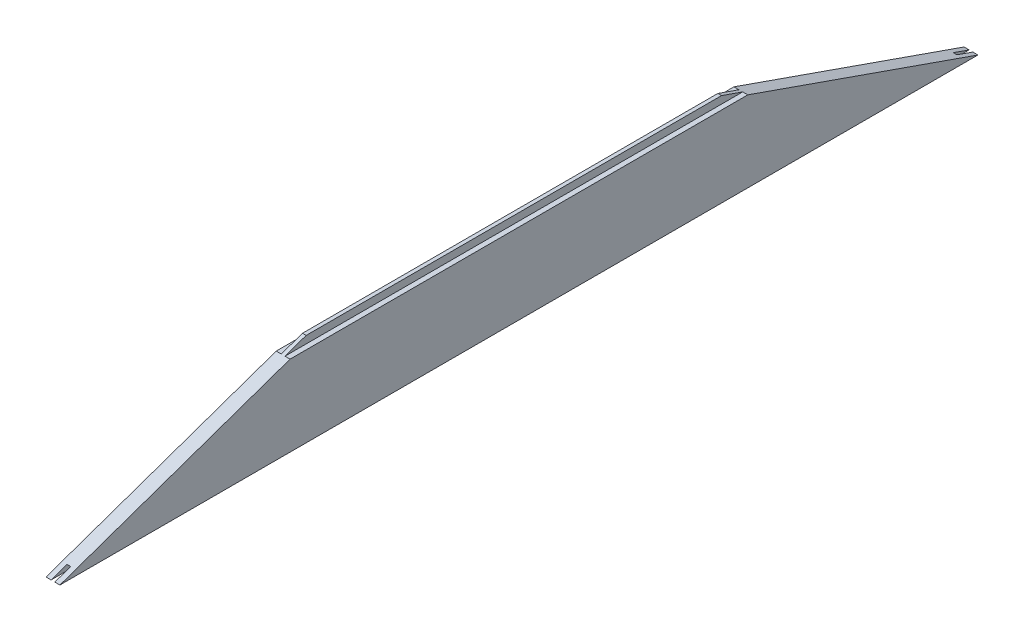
ISO-10303-21;
HEADER;
FILE_DESCRIPTION(('STEP AP214'),'2;1');
FILE_NAME('part.step','',(''),(''),'','','');
FILE_SCHEMA(('AUTOMOTIVE_DESIGN { 1 0 10303 214 1 1 1 1 }'));
ENDSEC;
DATA;
#1=APPLICATION_CONTEXT('core data for automotive mechanical design processes');
#2=APPLICATION_PROTOCOL_DEFINITION('international standard','automotive_design',2000,#1);
#3=PRODUCT_CONTEXT('',#1,'mechanical');
#4=PRODUCT('Part','Part','',(#3));
#5=PRODUCT_RELATED_PRODUCT_CATEGORY('part','',(#4));
#6=PRODUCT_DEFINITION_FORMATION('','',#4);
#7=PRODUCT_DEFINITION_CONTEXT('part definition',#1,'design');
#8=PRODUCT_DEFINITION('design','',#6,#7);
#9=PRODUCT_DEFINITION_SHAPE('','',#8);
#10=(LENGTH_UNIT() NAMED_UNIT(*) SI_UNIT(.MILLI.,.METRE.));
#11=(NAMED_UNIT(*) PLANE_ANGLE_UNIT() SI_UNIT($,.RADIAN.));
#12=(NAMED_UNIT(*) SI_UNIT($,.STERADIAN.) SOLID_ANGLE_UNIT());
#13=UNCERTAINTY_MEASURE_WITH_UNIT(LENGTH_MEASURE(1.E-05),#10,'distance_accuracy_value','');
#14=(GEOMETRIC_REPRESENTATION_CONTEXT(3) GLOBAL_UNCERTAINTY_ASSIGNED_CONTEXT((#13)) GLOBAL_UNIT_ASSIGNED_CONTEXT((#10,
#11,#12)) REPRESENTATION_CONTEXT('',''));
#15=CARTESIAN_POINT('',(0.,0.,0.));
#16=DIRECTION('',(0.,0.,1.));
#17=DIRECTION('',(1.,0.,0.));
#18=AXIS2_PLACEMENT_3D('',#15,#16,#17);
#19=CARTESIAN_POINT('',(2.00000000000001,0.,991.4));
#20=DIRECTION('',(1.,0.,0.));
#21=DIRECTION('',(0.,1.,0.));
#22=AXIS2_PLACEMENT_3D('',#19,#20,#21);
#23=PLANE('',#22);
#24=DIRECTION('',(0.,0.330349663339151,-0.943858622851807));
#25=VECTOR('',#24,1.);
#26=CARTESIAN_POINT('',(2.00000000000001,-38.7528058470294,977.836553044));
#27=LINE('',#26,#25);
#28=CARTESIAN_POINT('',(2.,43.5,742.827928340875));
#29=VERTEX_POINT('',#28);
#30=CARTESIAN_POINT('',(2.,51.5,719.970726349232));
#31=VERTEX_POINT('',#30);
#32=EDGE_CURVE('E229',#29,#31,#27,.T.);
#33=ORIENTED_EDGE('',*,*,#32,.F.);
#34=DIRECTION('',(0.,0.,-1.));
#35=VECTOR('',#34,1.);
#36=CARTESIAN_POINT('',(2.,43.5,991.4));
#37=LINE('',#36,#35);
#38=CARTESIAN_POINT('',(2.,43.5,248.572071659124));
#39=VERTEX_POINT('',#38);
#40=EDGE_CURVE('E143',#29,#39,#37,.T.);
#41=ORIENTED_EDGE('',*,*,#40,.T.);
#42=DIRECTION('',(0.,0.330349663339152,0.943858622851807));
#43=VECTOR('',#42,1.);
#44=CARTESIAN_POINT('',(1.99999999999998,270.369063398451,896.771072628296));
#45=LINE('',#44,#43);
#46=CARTESIAN_POINT('',(2.,51.5,271.429273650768));
#47=VERTEX_POINT('',#46);
#48=EDGE_CURVE('E192',#39,#47,#45,.T.);
#49=ORIENTED_EDGE('',*,*,#48,.T.);
#50=DIRECTION('',(0.,0.,-1.));
#51=VECTOR('',#50,1.);
#52=CARTESIAN_POINT('',(2.,51.5,991.4));
#53=LINE('',#52,#51);
#54=EDGE_CURVE('E11',#31,#47,#53,.T.);
#55=ORIENTED_EDGE('',*,*,#54,.F.);
#56=EDGE_LOOP('',(#33,#41,#49,#55));
#57=FACE_BOUND('',#56,.T.);
#58=ADVANCED_FACE('F32',(#57),#23,.T.);
#59=CARTESIAN_POINT('',(0.,51.5,991.4));
#60=DIRECTION('',(0.,1.,0.));
#61=DIRECTION('',(0.,0.,1.));
#62=AXIS2_PLACEMENT_3D('',#59,#60,#61);
#63=PLANE('',#62);
#64=DIRECTION('',(1.,0.,0.));
#65=VECTOR('',#64,1.);
#66=CARTESIAN_POINT('',(-7.50000000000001,51.5,719.970726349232));
#67=LINE('',#66,#65);
#68=CARTESIAN_POINT('',(-2.,51.5,719.970726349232));
#69=VERTEX_POINT('',#68);
#70=EDGE_CURVE('E124',#69,#31,#67,.T.);
#71=ORIENTED_EDGE('',*,*,#70,.T.);
#72=ORIENTED_EDGE('',*,*,#54,.T.);
#73=DIRECTION('',(1.,0.,0.));
#74=VECTOR('',#73,1.);
#75=CARTESIAN_POINT('',(-7.50000000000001,51.5,271.429273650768));
#76=LINE('',#75,#74);
#77=CARTESIAN_POINT('',(-2.,51.5,271.429273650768));
#78=VERTEX_POINT('',#77);
#79=EDGE_CURVE('E183',#78,#47,#76,.T.);
#80=ORIENTED_EDGE('',*,*,#79,.F.);
#81=DIRECTION('',(0.,0.,-1.));
#82=VECTOR('',#81,1.);
#83=CARTESIAN_POINT('',(-2.,51.5,991.4));
#84=LINE('',#83,#82);
#85=EDGE_CURVE('E40',#69,#78,#84,.T.);
#86=ORIENTED_EDGE('',*,*,#85,.F.);
#87=EDGE_LOOP('',(#71,#72,#80,#86));
#88=FACE_BOUND('',#87,.T.);
#89=ADVANCED_FACE('F187',(#88),#63,.T.);
#90=CARTESIAN_POINT('',(-1.99999999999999,0.,991.4));
#91=DIRECTION('',(1.,0.,0.));
#92=DIRECTION('',(0.,1.,0.));
#93=AXIS2_PLACEMENT_3D('',#90,#91,#92);
#94=PLANE('',#93);
#95=DIRECTION('',(0.,0.,-1.));
#96=VECTOR('',#95,1.);
#97=CARTESIAN_POINT('',(-2.,43.5,991.4));
#98=LINE('',#97,#96);
#99=CARTESIAN_POINT('',(-2.,43.5,742.827928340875));
#100=VERTEX_POINT('',#99);
#101=CARTESIAN_POINT('',(-2.,43.5,248.572071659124));
#102=VERTEX_POINT('',#101);
#103=EDGE_CURVE('E166',#100,#102,#98,.T.);
#104=ORIENTED_EDGE('',*,*,#103,.F.);
#105=DIRECTION('',(0.,0.330349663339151,-0.943858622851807));
#106=VECTOR('',#105,1.);
#107=CARTESIAN_POINT('',(-1.99999999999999,-38.7528058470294,977.836553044));
#108=LINE('',#107,#106);
#109=EDGE_CURVE('E174',#100,#69,#108,.T.);
#110=ORIENTED_EDGE('',*,*,#109,.T.);
#111=ORIENTED_EDGE('',*,*,#85,.T.);
#112=DIRECTION('',(0.,0.330349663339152,0.943858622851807));
#113=VECTOR('',#112,1.);
#114=CARTESIAN_POINT('',(-2.00000000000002,270.369063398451,896.771072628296));
#115=LINE('',#114,#113);
#116=EDGE_CURVE('E148',#102,#78,#115,.T.);
#117=ORIENTED_EDGE('',*,*,#116,.F.);
#118=EDGE_LOOP('',(#104,#110,#111,#117));
#119=FACE_BOUND('',#118,.T.);
#120=ADVANCED_FACE('F173',(#119),#94,.F.);
#121=CARTESIAN_POINT('',(0.,43.5,991.4));
#122=DIRECTION('',(0.,1.,0.));
#123=DIRECTION('',(0.,0.,1.));
#124=AXIS2_PLACEMENT_3D('',#121,#122,#123);
#125=PLANE('',#124);
#126=DIRECTION('',(-1.,0.,0.));
#127=VECTOR('',#126,1.);
#128=CARTESIAN_POINT('',(0.,43.5,742.827928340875));
#129=LINE('',#128,#127);
#130=CARTESIAN_POINT('',(-7.50000000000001,43.5000000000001,742.827928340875));
#131=VERTEX_POINT('',#130);
#132=EDGE_CURVE('E120',#100,#131,#129,.T.);
#133=ORIENTED_EDGE('',*,*,#132,.F.);
#134=ORIENTED_EDGE('',*,*,#103,.T.);
#135=DIRECTION('',(-1.,0.,0.));
#136=VECTOR('',#135,1.);
#137=CARTESIAN_POINT('',(0.,43.5,248.572071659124));
#138=LINE('',#137,#136);
#139=CARTESIAN_POINT('',(-7.50000000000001,43.5,248.572071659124));
#140=VERTEX_POINT('',#139);
#141=EDGE_CURVE('E186',#102,#140,#138,.T.);
#142=ORIENTED_EDGE('',*,*,#141,.T.);
#143=DIRECTION('',(0.,0.,-1.));
#144=VECTOR('',#143,1.);
#145=CARTESIAN_POINT('',(-7.50000000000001,43.5,991.4));
#146=LINE('',#145,#144);
#147=EDGE_CURVE('E134',#131,#140,#146,.T.);
#148=ORIENTED_EDGE('',*,*,#147,.F.);
#149=EDGE_LOOP('',(#133,#134,#142,#148));
#150=FACE_BOUND('',#149,.T.);
#151=ADVANCED_FACE('F208',(#150),#125,.T.);
#152=CARTESIAN_POINT('',(-7.5,0.,991.4));
#153=DIRECTION('',(1.,0.,0.));
#154=DIRECTION('',(0.,1.,0.));
#155=AXIS2_PLACEMENT_3D('',#152,#153,#154);
#156=PLANE('',#155);
#157=DIRECTION('',(0.,0.,-1.));
#158=VECTOR('',#157,1.);
#159=CARTESIAN_POINT('',(-7.5,-43.5,991.4));
#160=LINE('',#159,#158);
#161=CARTESIAN_POINT('',(-7.50000000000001,-43.5,991.4));
#162=VERTEX_POINT('',#161);
#163=CARTESIAN_POINT('',(-7.50000000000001,-43.5,0.));
#164=VERTEX_POINT('',#163);
#165=EDGE_CURVE('E128',#162,#164,#160,.T.);
#166=ORIENTED_EDGE('',*,*,#165,.F.);
#167=DIRECTION('',(0.,0.330349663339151,-0.943858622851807));
#168=VECTOR('',#167,1.);
#169=CARTESIAN_POINT('',(-7.50000000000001,-43.5,991.4));
#170=LINE('',#169,#168);
#171=EDGE_CURVE('E113',#162,#131,#170,.T.);
#172=ORIENTED_EDGE('',*,*,#171,.T.);
#173=ORIENTED_EDGE('',*,*,#147,.T.);
#174=DIRECTION('',(0.,0.330349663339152,0.943858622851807));
#175=VECTOR('',#174,1.);
#176=CARTESIAN_POINT('',(-7.50000000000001,-43.5,0.));
#177=LINE('',#176,#175);
#178=EDGE_CURVE('E131',#164,#140,#177,.T.);
#179=ORIENTED_EDGE('',*,*,#178,.F.);
#180=EDGE_LOOP('',(#166,#172,#173,#179));
#181=FACE_BOUND('',#180,.T.);
#182=ADVANCED_FACE('F129',(#181),#156,.F.);
#183=CARTESIAN_POINT('',(-2.00000000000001,0.,991.4));
#184=DIRECTION('',(1.,0.,0.));
#185=DIRECTION('',(0.,1.,0.));
#186=AXIS2_PLACEMENT_3D('',#183,#184,#185);
#187=PLANE('',#186);
#188=DIRECTION('',(0.,0.330349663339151,-0.943858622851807));
#189=VECTOR('',#188,1.);
#190=CARTESIAN_POINT('',(-2.,-38.7528058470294,977.836553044));
#191=LINE('',#190,#189);
#192=CARTESIAN_POINT('',(-2.,-43.5,991.4));
#193=VERTEX_POINT('',#192);
#194=CARTESIAN_POINT('',(-2.,-37.5,974.257098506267));
#195=VERTEX_POINT('',#194);
#196=EDGE_CURVE('E209',#193,#195,#191,.T.);
#197=ORIENTED_EDGE('',*,*,#196,.F.);
#198=DIRECTION('',(0.,0.,-1.));
#199=VECTOR('',#198,1.);
#200=CARTESIAN_POINT('',(-2.,-43.5,991.4));
#201=LINE('',#200,#199);
#202=CARTESIAN_POINT('',(-2.,-43.5,0.));
#203=VERTEX_POINT('',#202);
#204=EDGE_CURVE('E135',#193,#203,#201,.T.);
#205=ORIENTED_EDGE('',*,*,#204,.T.);
#206=DIRECTION('',(0.,0.330349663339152,0.943858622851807));
#207=VECTOR('',#206,1.);
#208=CARTESIAN_POINT('',(-2.00000000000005,270.369063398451,896.771072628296));
#209=LINE('',#208,#207);
#210=CARTESIAN_POINT('',(-2.,-37.5,17.1429014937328));
#211=VERTEX_POINT('',#210);
#212=EDGE_CURVE('E205',#203,#211,#209,.T.);
#213=ORIENTED_EDGE('',*,*,#212,.T.);
#214=DIRECTION('',(0.,0.,-1.));
#215=VECTOR('',#214,1.);
#216=CARTESIAN_POINT('',(-2.,-37.5,991.4));
#217=LINE('',#216,#215);
#218=EDGE_CURVE('E162',#195,#211,#217,.T.);
#219=ORIENTED_EDGE('',*,*,#218,.F.);
#220=EDGE_LOOP('',(#197,#205,#213,#219));
#221=FACE_BOUND('',#220,.T.);
#222=ADVANCED_FACE('F241',(#221),#187,.T.);
#223=CARTESIAN_POINT('',(0.,-37.5,991.4));
#224=DIRECTION('',(0.,1.,0.));
#225=DIRECTION('',(0.,0.,1.));
#226=AXIS2_PLACEMENT_3D('',#223,#224,#225);
#227=PLANE('',#226);
#228=DIRECTION('',(0.,0.,-1.));
#229=VECTOR('',#228,1.);
#230=CARTESIAN_POINT('',(2.,-37.5,991.4));
#231=LINE('',#230,#229);
#232=CARTESIAN_POINT('',(2.,-37.5,974.257098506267));
#233=VERTEX_POINT('',#232);
#234=CARTESIAN_POINT('',(2.,-37.5,17.1429014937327));
#235=VERTEX_POINT('',#234);
#236=EDGE_CURVE('E160',#233,#235,#231,.T.);
#237=ORIENTED_EDGE('',*,*,#236,.F.);
#238=DIRECTION('',(-1.,0.,0.));
#239=VECTOR('',#238,1.);
#240=CARTESIAN_POINT('',(0.,-37.5,974.257098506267));
#241=LINE('',#240,#239);
#242=EDGE_CURVE('E212',#233,#195,#241,.T.);
#243=ORIENTED_EDGE('',*,*,#242,.T.);
#244=ORIENTED_EDGE('',*,*,#218,.T.);
#245=DIRECTION('',(-1.,0.,0.));
#246=VECTOR('',#245,1.);
#247=CARTESIAN_POINT('',(0.,-37.5,17.1429014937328));
#248=LINE('',#247,#246);
#249=EDGE_CURVE('E202',#235,#211,#248,.T.);
#250=ORIENTED_EDGE('',*,*,#249,.F.);
#251=EDGE_LOOP('',(#237,#243,#244,#250));
#252=FACE_BOUND('',#251,.T.);
#253=ADVANCED_FACE('F238',(#252),#227,.F.);
#254=CARTESIAN_POINT('',(1.99999999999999,0.,991.4));
#255=DIRECTION('',(1.,0.,0.));
#256=DIRECTION('',(0.,1.,0.));
#257=AXIS2_PLACEMENT_3D('',#254,#255,#256);
#258=PLANE('',#257);
#259=DIRECTION('',(0.,0.,-1.));
#260=VECTOR('',#259,1.);
#261=CARTESIAN_POINT('',(2.,-43.5,991.4));
#262=LINE('',#261,#260);
#263=CARTESIAN_POINT('',(2.,-43.5,991.4));
#264=VERTEX_POINT('',#263);
#265=CARTESIAN_POINT('',(1.99999999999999,-43.5,0.));
#266=VERTEX_POINT('',#265);
#267=EDGE_CURVE('E157',#264,#266,#262,.T.);
#268=ORIENTED_EDGE('',*,*,#267,.F.);
#269=DIRECTION('',(0.,0.330349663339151,-0.943858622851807));
#270=VECTOR('',#269,1.);
#271=CARTESIAN_POINT('',(2.,-38.7528058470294,977.836553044));
#272=LINE('',#271,#270);
#273=EDGE_CURVE('E46',#264,#233,#272,.T.);
#274=ORIENTED_EDGE('',*,*,#273,.T.);
#275=ORIENTED_EDGE('',*,*,#236,.T.);
#276=DIRECTION('',(0.,0.330349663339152,0.943858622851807));
#277=VECTOR('',#276,1.);
#278=CARTESIAN_POINT('',(1.99999999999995,270.369063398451,896.771072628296));
#279=LINE('',#278,#277);
#280=EDGE_CURVE('E199',#266,#235,#279,.T.);
#281=ORIENTED_EDGE('',*,*,#280,.F.);
#282=EDGE_LOOP('',(#268,#274,#275,#281));
#283=FACE_BOUND('',#282,.T.);
#284=ADVANCED_FACE('F243',(#283),#258,.F.);
#285=CARTESIAN_POINT('',(7.49999999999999,0.,991.4));
#286=DIRECTION('',(1.,0.,0.));
#287=DIRECTION('',(0.,1.,0.));
#288=AXIS2_PLACEMENT_3D('',#285,#286,#287);
#289=PLANE('',#288);
#290=DIRECTION('',(0.,0.330349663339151,-0.943858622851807));
#291=VECTOR('',#290,1.);
#292=CARTESIAN_POINT('',(7.5,-43.5,991.4));
#293=LINE('',#292,#291);
#294=CARTESIAN_POINT('',(7.5,-43.5,991.4));
#295=VERTEX_POINT('',#294);
#296=CARTESIAN_POINT('',(7.5,43.5,742.827928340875));
#297=VERTEX_POINT('',#296);
#298=EDGE_CURVE('E123',#295,#297,#293,.T.);
#299=ORIENTED_EDGE('',*,*,#298,.F.);
#300=DIRECTION('',(0.,0.,-1.));
#301=VECTOR('',#300,1.);
#302=CARTESIAN_POINT('',(7.5,-43.5,991.4));
#303=LINE('',#302,#301);
#304=CARTESIAN_POINT('',(7.5,-43.5,0.));
#305=VERTEX_POINT('',#304);
#306=EDGE_CURVE('E154',#295,#305,#303,.T.);
#307=ORIENTED_EDGE('',*,*,#306,.T.);
#308=DIRECTION('',(0.,0.330349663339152,0.943858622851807));
#309=VECTOR('',#308,1.);
#310=CARTESIAN_POINT('',(7.5,-43.5,0.));
#311=LINE('',#310,#309);
#312=CARTESIAN_POINT('',(7.5,43.5,248.572071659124));
#313=VERTEX_POINT('',#312);
#314=EDGE_CURVE('E194',#305,#313,#311,.T.);
#315=ORIENTED_EDGE('',*,*,#314,.T.);
#316=DIRECTION('',(0.,0.,-1.));
#317=VECTOR('',#316,1.);
#318=CARTESIAN_POINT('',(7.49999999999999,43.5,991.4));
#319=LINE('',#318,#317);
#320=EDGE_CURVE('E152',#297,#313,#319,.T.);
#321=ORIENTED_EDGE('',*,*,#320,.F.);
#322=EDGE_LOOP('',(#299,#307,#315,#321));
#323=FACE_BOUND('',#322,.T.);
#324=ADVANCED_FACE('F219',(#323),#289,.T.);
#325=DIRECTION('',(-1.,0.,0.));
#326=VECTOR('',#325,1.);
#327=CARTESIAN_POINT('',(0.,43.5,742.827928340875));
#328=LINE('',#327,#326);
#329=EDGE_CURVE('E227',#297,#29,#328,.T.);
#330=ORIENTED_EDGE('',*,*,#329,.F.);
#331=ORIENTED_EDGE('',*,*,#320,.T.);
#332=DIRECTION('',(-1.,0.,0.));
#333=VECTOR('',#332,1.);
#334=CARTESIAN_POINT('',(0.,43.5,248.572071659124));
#335=LINE('',#334,#333);
#336=EDGE_CURVE('E189',#313,#39,#335,.T.);
#337=ORIENTED_EDGE('',*,*,#336,.T.);
#338=ORIENTED_EDGE('',*,*,#40,.F.);
#339=EDGE_LOOP('',(#330,#331,#337,#338));
#340=FACE_BOUND('',#339,.T.);
#341=ADVANCED_FACE('F226',(#340),#125,.T.);
#342=CARTESIAN_POINT('',(0.,-43.5,991.4));
#343=DIRECTION('',(0.,1.,0.));
#344=DIRECTION('',(0.,0.,1.));
#345=AXIS2_PLACEMENT_3D('',#342,#343,#344);
#346=PLANE('',#345);
#347=DIRECTION('',(1.,0.,0.));
#348=VECTOR('',#347,1.);
#349=CARTESIAN_POINT('',(0.,-43.5,0.));
#350=LINE('',#349,#348);
#351=EDGE_CURVE('E145',#164,#203,#350,.T.);
#352=ORIENTED_EDGE('',*,*,#351,.T.);
#353=ORIENTED_EDGE('',*,*,#204,.F.);
#354=DIRECTION('',(1.,0.,0.));
#355=VECTOR('',#354,1.);
#356=CARTESIAN_POINT('',(0.,-43.5,991.4));
#357=LINE('',#356,#355);
#358=EDGE_CURVE('E117',#162,#193,#357,.T.);
#359=ORIENTED_EDGE('',*,*,#358,.F.);
#360=ORIENTED_EDGE('',*,*,#165,.T.);
#361=EDGE_LOOP('',(#352,#353,#359,#360));
#362=FACE_BOUND('',#361,.T.);
#363=ADVANCED_FACE('F138',(#362),#346,.F.);
#364=EDGE_CURVE('E141',#266,#305,#350,.T.);
#365=ORIENTED_EDGE('',*,*,#364,.T.);
#366=ORIENTED_EDGE('',*,*,#306,.F.);
#367=EDGE_CURVE('E140',#264,#295,#357,.T.);
#368=ORIENTED_EDGE('',*,*,#367,.F.);
#369=ORIENTED_EDGE('',*,*,#267,.T.);
#370=EDGE_LOOP('',(#365,#366,#368,#369));
#371=FACE_BOUND('',#370,.T.);
#372=ADVANCED_FACE('F246',(#371),#346,.F.);
#373=CARTESIAN_POINT('',(-7.50000000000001,-43.5,0.));
#374=DIRECTION('',(0.,0.943858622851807,-0.330349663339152));
#375=DIRECTION('',(0.,0.330349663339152,0.943858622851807));
#376=AXIS2_PLACEMENT_3D('',#373,#374,#375);
#377=PLANE('',#376);
#378=ORIENTED_EDGE('',*,*,#116,.T.);
#379=ORIENTED_EDGE('',*,*,#79,.T.);
#380=ORIENTED_EDGE('',*,*,#48,.F.);
#381=ORIENTED_EDGE('',*,*,#336,.F.);
#382=ORIENTED_EDGE('',*,*,#314,.F.);
#383=ORIENTED_EDGE('',*,*,#364,.F.);
#384=ORIENTED_EDGE('',*,*,#280,.T.);
#385=ORIENTED_EDGE('',*,*,#249,.T.);
#386=ORIENTED_EDGE('',*,*,#212,.F.);
#387=ORIENTED_EDGE('',*,*,#351,.F.);
#388=ORIENTED_EDGE('',*,*,#178,.T.);
#389=ORIENTED_EDGE('',*,*,#141,.F.);
#390=EDGE_LOOP('',(#378,#379,#380,#381,#382,#383,#384,#385,#386,#387,#388,#389));
#391=FACE_BOUND('',#390,.T.);
#392=ADVANCED_FACE('F181',(#391),#377,.T.);
#393=CARTESIAN_POINT('',(-7.50000000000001,-43.5,991.4));
#394=DIRECTION('',(0.,-0.943858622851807,-0.330349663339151));
#395=DIRECTION('',(0.,0.330349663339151,-0.943858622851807));
#396=AXIS2_PLACEMENT_3D('',#393,#394,#395);
#397=PLANE('',#396);
#398=ORIENTED_EDGE('',*,*,#132,.T.);
#399=ORIENTED_EDGE('',*,*,#171,.F.);
#400=ORIENTED_EDGE('',*,*,#358,.T.);
#401=ORIENTED_EDGE('',*,*,#196,.T.);
#402=ORIENTED_EDGE('',*,*,#242,.F.);
#403=ORIENTED_EDGE('',*,*,#273,.F.);
#404=ORIENTED_EDGE('',*,*,#367,.T.);
#405=ORIENTED_EDGE('',*,*,#298,.T.);
#406=ORIENTED_EDGE('',*,*,#329,.T.);
#407=ORIENTED_EDGE('',*,*,#32,.T.);
#408=ORIENTED_EDGE('',*,*,#70,.F.);
#409=ORIENTED_EDGE('',*,*,#109,.F.);
#410=EDGE_LOOP('',(#398,#399,#400,#401,#402,#403,#404,#405,#406,#407,#408,#409));
#411=FACE_BOUND('',#410,.T.);
#412=ADVANCED_FACE('F115',(#411),#397,.F.);
#413=CLOSED_SHELL('',(#58,#89,#120,#151,#182,#222,#253,#284,#324,#341,#363,#372,#392,#412));
#414=MANIFOLD_SOLID_BREP('B2',#413);
#415=ADVANCED_BREP_SHAPE_REPRESENTATION('',(#18,#414),#14);
#416=SHAPE_DEFINITION_REPRESENTATION(#9,#415);
ENDSEC;
END-ISO-10303-21;
